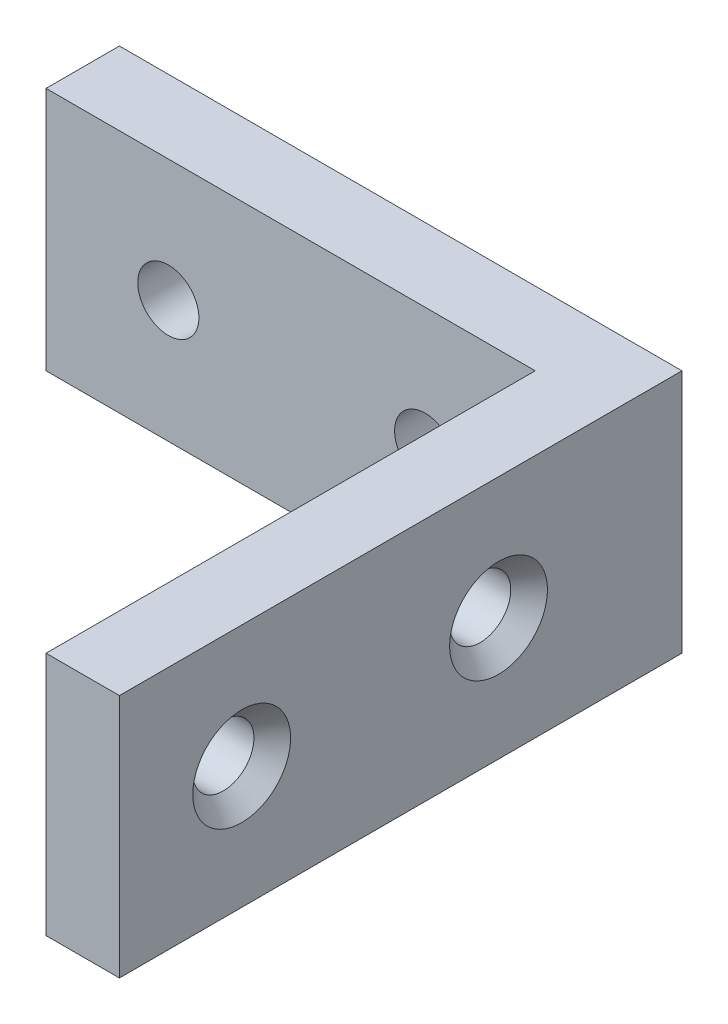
from build123d import *

# Parameters (mm, degrees)
BOSS_EXTRU_1_DEPTH      = 20
ENL_V_MAT_EXTRU_1_REACH = 66.156
ESQUISSE3_R             = 2.5
ESQUISSE4_R             = 2.5
ENL_V_MAT_EXTRU_2_DEPTH = 20
CHANFREIN1_SIZE         = 1.5


with BuildPart() as part:
    # Esquisse2 → Boss.-Extru.1 (new body)
    with BuildSketch(Plane(origin=(0, 0, 0), x_dir=(1, 0, 0), z_dir=(0, 1, 0))):
        Polygon((0, 0), (40, 0), (40, -40), (46, -40), (46, 6), (0, 6), align=None)
    extrude(amount=BOSS_EXTRU_1_DEPTH)

    # Esquisse3 → Enl_v. mat.-Extru.1 (cut, up to next)
    with BuildSketch(Plane(origin=(46, 0, 0), x_dir=(0, 0, -1), z_dir=(1, 0, 0)), mode=Mode.PRIVATE) as enl_v_mat_extru_1_sk1:
        with Locations((-30, 10)):
            Circle(ESQUISSE3_R)
    enl_v_mat_extru_1_tool1 = extrude(enl_v_mat_extru_1_sk1.sketch, amount=-ENL_V_MAT_EXTRU_1_REACH, mode=Mode.PRIVATE) & part.part
    # Esquisse3 → Enl_v. mat.-Extru.1 (cut, up to next)
    with BuildSketch(Plane(origin=(46, 0, 0), x_dir=(0, 0, -1), z_dir=(1, 0, 0)), mode=Mode.PRIVATE) as enl_v_mat_extru_1_sk2:
        with Locations((-9, 10)):
            Circle(ESQUISSE3_R)
    enl_v_mat_extru_1_tool2 = extrude(enl_v_mat_extru_1_sk2.sketch, amount=-ENL_V_MAT_EXTRU_1_REACH, mode=Mode.PRIVATE) & part.part
    add(enl_v_mat_extru_1_tool1.solids().sort_by_distance((46, 10, 30))[0], mode=Mode.SUBTRACT)
    add(enl_v_mat_extru_1_tool2.solids().sort_by_distance((46, 10, 9))[0], mode=Mode.SUBTRACT)

    # Esquisse4 → Enl_v. mat.-Extru.2 (cut)
    with BuildSketch(Plane(origin=(0, 0, -6), x_dir=(-1, 0, 0), z_dir=(0, 0, -1))):
        with Locations((-10, 10)):
            Circle(ESQUISSE4_R)
        with Locations((-31, 10)):
            Circle(ESQUISSE4_R)
    extrude(amount=-ENL_V_MAT_EXTRU_2_DEPTH, mode=Mode.SUBTRACT)

    # Chanfrein1
    chanfrein1_edges = [part.edges().sort_by_distance(p)[0] for p in [
        (46, 10, 32.5),
        (46, 10, 11.5),
        (12.5, 10, -6),
        (33.5, 10, -6),
    ]]
    chamfer(chanfrein1_edges, length=CHANFREIN1_SIZE)


solid = part.part
